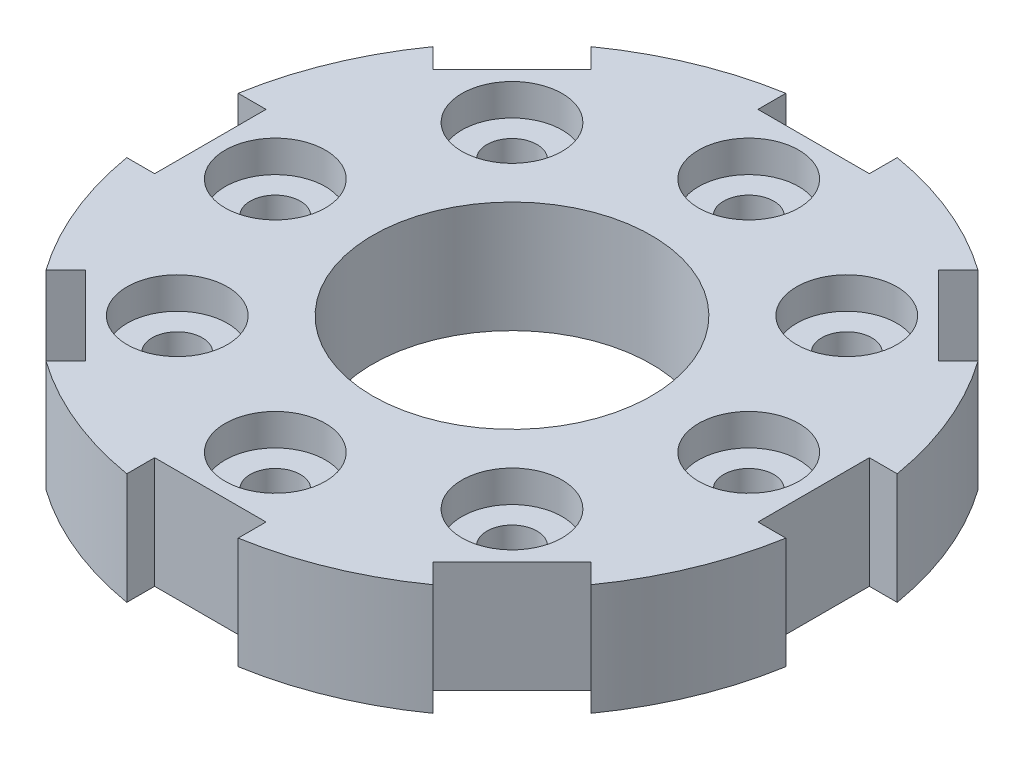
from build123d import *

# Parameters (mm, degrees)
SKETCH1_R                               = 60
SKETCH1_R_2                             = 25
EXTRUDE1_DEPTH                          = 20
CBORE_FOR_M8_HEX_HEAD_BOLT1_D           = 9
CBORE_FOR_M8_HEX_HEAD_BOLT1_CBORE_D     = 18.01
CBORE_FOR_M8_HEX_HEAD_BOLT1_CBORE_DEPTH = 5.68
CUT_EXTRUDE1_DEPTH                      = 88.177978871
CIRPATTERN1_COUNT                       = 8


with BuildPart() as part:
    # Sketch1 → Extrude1 (new body)
    with BuildSketch(Plane(origin=(0, 0, 0), x_dir=(1, 0, 0), z_dir=(0, 1, 0))):
        with Locations(Location((0, 0, 0), (0, 0, 270))):
            Circle(SKETCH1_R)
        with Locations(Location((0, 0, 0), (0, 0, 270))):
            Circle(SKETCH1_R_2, mode=Mode.SUBTRACT)
    extrude(amount=EXTRUDE1_DEPTH)

    # CBORE for M8 Hex Head Bolt1 (through all)
    with Locations(Plane(origin=(0, 20, 0), x_dir=(-1, 0, 0), z_dir=(0, 1, 0))):
        with Locations((-42.5, 0)):
            cbore_for_m8_hex_head_bolt1 = CounterBoreHole(CBORE_FOR_M8_HEX_HEAD_BOLT1_D / 2, CBORE_FOR_M8_HEX_HEAD_BOLT1_CBORE_D / 2, CBORE_FOR_M8_HEX_HEAD_BOLT1_CBORE_DEPTH)

    # Sketch5 → Cut-Extrude1 (cut, through all)
    with BuildSketch(Plane(origin=(0, 20, 0), x_dir=(-1, 0, 0), z_dir=(0, 1, 0))):
        with BuildLine():
            Line((-54.160797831, 10), (-59.160797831, 10))
            ThreePointArc((-59.160797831, 10), (-60, 0), (-59.160797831, -10))
            Line((-59.160797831, -10), (-54.160797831, -10))
            Line((-54.160797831, -10), (-54.160797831, 10))
        make_face()
    cut_extrude1 = extrude(amount=-CUT_EXTRUDE1_DEPTH, mode=Mode.SUBTRACT)

    # CirPattern1: CBORE for M8 Hex Head Bolt1, Cut-Extrude1 ×8 about axis
    cirpattern1_axis = Axis((0, 0, 0), (0, 1, 0))
    add([cbore_for_m8_hex_head_bolt1.rotate(cirpattern1_axis, i * 360 / CIRPATTERN1_COUNT) for i in range(1, CIRPATTERN1_COUNT)], mode=Mode.SUBTRACT)
    add([cut_extrude1.rotate(cirpattern1_axis, i * 360 / CIRPATTERN1_COUNT) for i in range(1, CIRPATTERN1_COUNT)], mode=Mode.SUBTRACT)


solid = part.part
